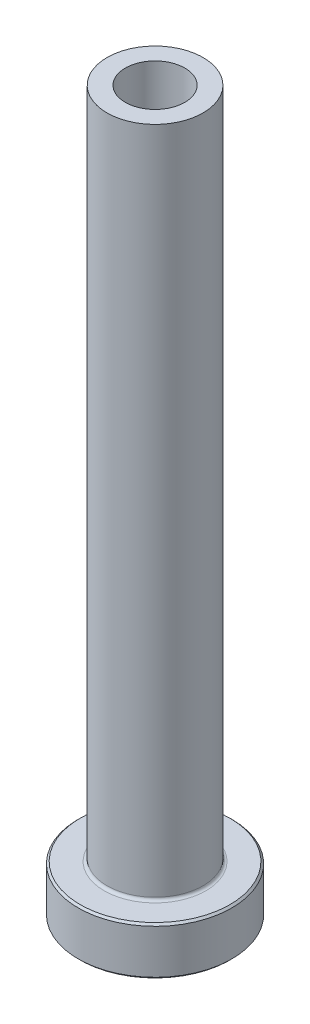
ISO-10303-21;
HEADER;
FILE_DESCRIPTION(('STEP AP214'),'2;1');
FILE_NAME('part.step','',(''),(''),'','','');
FILE_SCHEMA(('AUTOMOTIVE_DESIGN { 1 0 10303 214 1 1 1 1 }'));
ENDSEC;
DATA;
#1=APPLICATION_CONTEXT('core data for automotive mechanical design processes');
#2=APPLICATION_PROTOCOL_DEFINITION('international standard','automotive_design',2000,#1);
#3=PRODUCT_CONTEXT('',#1,'mechanical');
#4=PRODUCT('Part','Part','',(#3));
#5=PRODUCT_RELATED_PRODUCT_CATEGORY('part','',(#4));
#6=PRODUCT_DEFINITION_FORMATION('','',#4);
#7=PRODUCT_DEFINITION_CONTEXT('part definition',#1,'design');
#8=PRODUCT_DEFINITION('design','',#6,#7);
#9=PRODUCT_DEFINITION_SHAPE('','',#8);
#10=(LENGTH_UNIT() NAMED_UNIT(*) SI_UNIT(.MILLI.,.METRE.));
#11=(NAMED_UNIT(*) PLANE_ANGLE_UNIT() SI_UNIT($,.RADIAN.));
#12=(NAMED_UNIT(*) SI_UNIT($,.STERADIAN.) SOLID_ANGLE_UNIT());
#13=UNCERTAINTY_MEASURE_WITH_UNIT(LENGTH_MEASURE(1.E-05),#10,'distance_accuracy_value','');
#14=(GEOMETRIC_REPRESENTATION_CONTEXT(3) GLOBAL_UNCERTAINTY_ASSIGNED_CONTEXT((#13)) GLOBAL_UNIT_ASSIGNED_CONTEXT((#10,
#11,#12)) REPRESENTATION_CONTEXT('',''));
#15=CARTESIAN_POINT('',(0.,0.,0.));
#16=DIRECTION('',(0.,0.,1.));
#17=DIRECTION('',(1.,0.,0.));
#18=AXIS2_PLACEMENT_3D('',#15,#16,#17);
#19=CARTESIAN_POINT('',(0.,92.1876809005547,0.));
#20=DIRECTION('',(0.,1.,0.));
#21=DIRECTION('',(0.,0.,1.));
#22=AXIS2_PLACEMENT_3D('',#19,#20,#21);
#23=CYLINDRICAL_SURFACE('',#22,3.10000000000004);
#24=CARTESIAN_POINT('',(0.,75.,0.));
#25=DIRECTION('',(0.,1.,0.));
#26=DIRECTION('',(0.,0.,1.));
#27=AXIS2_PLACEMENT_3D('',#24,#25,#26);
#28=CIRCLE('',#27,3.10000000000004);
#29=CARTESIAN_POINT('',(0.,75.,3.10000000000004));
#30=VERTEX_POINT('',#29);
#31=EDGE_CURVE('E62',#30,#30,#28,.T.);
#32=ORIENTED_EDGE('',*,*,#31,.T.);
#33=EDGE_LOOP('',(#32));
#34=FACE_BOUND('',#33,.T.);
#35=CARTESIAN_POINT('',(0.,30.,0.));
#36=DIRECTION('',(0.,1.,0.));
#37=DIRECTION('',(0.,0.,1.));
#38=AXIS2_PLACEMENT_3D('',#35,#36,#37);
#39=CIRCLE('',#38,3.10000000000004);
#40=CARTESIAN_POINT('',(0.,30.,3.10000000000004));
#41=VERTEX_POINT('',#40);
#42=EDGE_CURVE('E71',#41,#41,#39,.T.);
#43=ORIENTED_EDGE('',*,*,#42,.F.);
#44=EDGE_LOOP('',(#43));
#45=FACE_BOUND('',#44,.T.);
#46=ADVANCED_FACE('F30',(#34,#45),#23,.F.);
#47=CARTESIAN_POINT('',(-3.10000000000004,75.,0.));
#48=DIRECTION('',(0.,1.,0.));
#49=DIRECTION('',(0.,0.,1.));
#50=AXIS2_PLACEMENT_3D('',#47,#48,#49);
#51=PLANE('',#50);
#52=CARTESIAN_POINT('',(0.,75.,0.));
#53=DIRECTION('',(0.,1.,0.));
#54=DIRECTION('',(0.,0.,1.));
#55=AXIS2_PLACEMENT_3D('',#52,#53,#54);
#56=CIRCLE('',#55,5.);
#57=CARTESIAN_POINT('',(0.,75.,5.));
#58=VERTEX_POINT('',#57);
#59=EDGE_CURVE('E65',#58,#58,#56,.T.);
#60=ORIENTED_EDGE('',*,*,#59,.T.);
#61=EDGE_LOOP('',(#60));
#62=FACE_BOUND('',#61,.T.);
#63=ORIENTED_EDGE('',*,*,#31,.F.);
#64=EDGE_LOOP('',(#63));
#65=FACE_BOUND('',#64,.T.);
#66=ADVANCED_FACE('F79',(#62,#65),#51,.T.);
#67=CARTESIAN_POINT('',(0.,92.1876809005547,0.));
#68=DIRECTION('',(0.,1.,0.));
#69=DIRECTION('',(0.,0.,1.));
#70=AXIS2_PLACEMENT_3D('',#67,#68,#69);
#71=CYLINDRICAL_SURFACE('',#70,4.99999999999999);
#72=CARTESIAN_POINT('',(0.,5.3,0.));
#73=DIRECTION('',(0.,1.,0.));
#74=DIRECTION('',(0.,0.,1.));
#75=AXIS2_PLACEMENT_3D('',#72,#73,#74);
#76=CIRCLE('',#75,4.99999999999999);
#77=CARTESIAN_POINT('',(0.,5.3,4.99999999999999));
#78=VERTEX_POINT('',#77);
#79=EDGE_CURVE('E59',#78,#78,#76,.T.);
#80=ORIENTED_EDGE('',*,*,#79,.T.);
#81=EDGE_LOOP('',(#80));
#82=FACE_BOUND('',#81,.T.);
#83=ORIENTED_EDGE('',*,*,#59,.F.);
#84=EDGE_LOOP('',(#83));
#85=FACE_BOUND('',#84,.T.);
#86=ADVANCED_FACE('F85',(#82,#85),#71,.T.);
#87=CARTESIAN_POINT('',(-4.99999999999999,5.,0.));
#88=DIRECTION('',(0.,1.,0.));
#89=DIRECTION('',(0.,0.,1.));
#90=AXIS2_PLACEMENT_3D('',#87,#88,#89);
#91=PLANE('',#90);
#92=CARTESIAN_POINT('',(0.,5.,0.));
#93=DIRECTION('',(0.,1.,0.));
#94=DIRECTION('',(0.,0.,1.));
#95=AXIS2_PLACEMENT_3D('',#92,#93,#94);
#96=CIRCLE('',#95,7.80000000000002);
#97=CARTESIAN_POINT('',(0.,5.,-7.80000000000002));
#98=VERTEX_POINT('',#97);
#99=EDGE_CURVE('E53',#98,#98,#96,.T.);
#100=ORIENTED_EDGE('',*,*,#99,.T.);
#101=EDGE_LOOP('',(#100));
#102=FACE_BOUND('',#101,.T.);
#103=CARTESIAN_POINT('',(0.,5.,0.));
#104=DIRECTION('',(0.,1.,0.));
#105=DIRECTION('',(0.,0.,1.));
#106=AXIS2_PLACEMENT_3D('',#103,#104,#105);
#107=CIRCLE('',#106,5.29999999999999);
#108=CARTESIAN_POINT('',(0.,5.,5.29999999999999));
#109=VERTEX_POINT('',#108);
#110=EDGE_CURVE('E56',#109,#109,#107,.F.);
#111=ORIENTED_EDGE('',*,*,#110,.T.);
#112=EDGE_LOOP('',(#111));
#113=FACE_BOUND('',#112,.T.);
#114=ADVANCED_FACE('F111',(#102,#113),#91,.T.);
#115=CARTESIAN_POINT('',(0.,92.1876809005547,0.));
#116=DIRECTION('',(0.,1.,0.));
#117=DIRECTION('',(0.,0.,1.));
#118=AXIS2_PLACEMENT_3D('',#115,#116,#117);
#119=CYLINDRICAL_SURFACE('',#118,7.99999999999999);
#120=CARTESIAN_POINT('',(0.,4.80000000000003,0.));
#121=DIRECTION('',(0.,1.,0.));
#122=DIRECTION('',(0.,0.,1.));
#123=AXIS2_PLACEMENT_3D('',#120,#121,#122);
#124=CIRCLE('',#123,7.99999999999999);
#125=CARTESIAN_POINT('',(0.,4.80000000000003,-7.99999999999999));
#126=VERTEX_POINT('',#125);
#127=EDGE_CURVE('E45',#126,#126,#124,.F.);
#128=ORIENTED_EDGE('',*,*,#127,.T.);
#129=EDGE_LOOP('',(#128));
#130=FACE_BOUND('',#129,.T.);
#131=CARTESIAN_POINT('',(0.,0.199999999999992,0.));
#132=DIRECTION('',(0.,-1.,0.));
#133=DIRECTION('',(0.,0.,-1.));
#134=AXIS2_PLACEMENT_3D('',#131,#132,#133);
#135=CIRCLE('',#134,7.99999999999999);
#136=CARTESIAN_POINT('',(0.,0.199999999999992,-7.99999999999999));
#137=VERTEX_POINT('',#136);
#138=EDGE_CURVE('E50',#137,#137,#135,.F.);
#139=ORIENTED_EDGE('',*,*,#138,.T.);
#140=EDGE_LOOP('',(#139));
#141=FACE_BOUND('',#140,.T.);
#142=ADVANCED_FACE('F108',(#130,#141),#119,.T.);
#143=CARTESIAN_POINT('',(-7.99999999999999,0.,0.));
#144=DIRECTION('',(0.,-1.,0.));
#145=DIRECTION('',(0.,0.,-1.));
#146=AXIS2_PLACEMENT_3D('',#143,#144,#145);
#147=PLANE('',#146);
#148=CARTESIAN_POINT('',(0.,0.,0.));
#149=DIRECTION('',(0.,-1.,0.));
#150=DIRECTION('',(0.,0.,-1.));
#151=AXIS2_PLACEMENT_3D('',#148,#149,#150);
#152=CIRCLE('',#151,3.84999999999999);
#153=CARTESIAN_POINT('',(0.,0.,-3.84999999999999));
#154=VERTEX_POINT('',#153);
#155=EDGE_CURVE('E37',#154,#154,#152,.F.);
#156=ORIENTED_EDGE('',*,*,#155,.T.);
#157=EDGE_LOOP('',(#156));
#158=FACE_BOUND('',#157,.T.);
#159=CARTESIAN_POINT('',(0.,0.,0.));
#160=DIRECTION('',(0.,-1.,0.));
#161=DIRECTION('',(0.,0.,-1.));
#162=AXIS2_PLACEMENT_3D('',#159,#160,#161);
#163=CIRCLE('',#162,7.79999999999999);
#164=CARTESIAN_POINT('',(0.,0.,-7.79999999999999));
#165=VERTEX_POINT('',#164);
#166=EDGE_CURVE('E41',#165,#165,#163,.T.);
#167=ORIENTED_EDGE('',*,*,#166,.T.);
#168=EDGE_LOOP('',(#167));
#169=FACE_BOUND('',#168,.T.);
#170=ADVANCED_FACE('F110',(#158,#169),#147,.T.);
#171=CARTESIAN_POINT('',(0.,92.1876809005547,0.));
#172=DIRECTION('',(0.,1.,0.));
#173=DIRECTION('',(0.,0.,1.));
#174=AXIS2_PLACEMENT_3D('',#171,#172,#173);
#175=CYLINDRICAL_SURFACE('',#174,3.34999999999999);
#176=CARTESIAN_POINT('',(0.,0.5,0.));
#177=DIRECTION('',(0.,-1.,0.));
#178=DIRECTION('',(0.,0.,-1.));
#179=AXIS2_PLACEMENT_3D('',#176,#177,#178);
#180=CIRCLE('',#179,3.34999999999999);
#181=CARTESIAN_POINT('',(0.,0.5,-3.34999999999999));
#182=VERTEX_POINT('',#181);
#183=EDGE_CURVE('E10',#182,#182,#180,.T.);
#184=ORIENTED_EDGE('',*,*,#183,.T.);
#185=EDGE_LOOP('',(#184));
#186=FACE_BOUND('',#185,.T.);
#187=CARTESIAN_POINT('',(0.,18.,0.));
#188=DIRECTION('',(0.,1.,0.));
#189=DIRECTION('',(0.,0.,1.));
#190=AXIS2_PLACEMENT_3D('',#187,#188,#189);
#191=CIRCLE('',#190,3.34999999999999);
#192=CARTESIAN_POINT('',(0.,18.,3.34999999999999));
#193=VERTEX_POINT('',#192);
#194=EDGE_CURVE('E68',#193,#193,#191,.T.);
#195=ORIENTED_EDGE('',*,*,#194,.T.);
#196=EDGE_LOOP('',(#195));
#197=FACE_BOUND('',#196,.T.);
#198=ADVANCED_FACE('F118',(#186,#197),#175,.F.);
#199=CARTESIAN_POINT('',(0.,18.,0.));
#200=DIRECTION('',(0.,-1.,0.));
#201=DIRECTION('',(0.,0.,-1.));
#202=AXIS2_PLACEMENT_3D('',#199,#200,#201);
#203=CONICAL_SURFACE('',#202,3.34999999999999,0.0208303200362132);
#204=ORIENTED_EDGE('',*,*,#42,.T.);
#205=EDGE_LOOP('',(#204));
#206=FACE_BOUND('',#205,.T.);
#207=ORIENTED_EDGE('',*,*,#194,.F.);
#208=EDGE_LOOP('',(#207));
#209=FACE_BOUND('',#208,.T.);
#210=ADVANCED_FACE('F75',(#206,#209),#203,.F.);
#211=CARTESIAN_POINT('',(0.,5.3,0.));
#212=DIRECTION('',(0.,1.,0.));
#213=DIRECTION('',(0.,0.,1.));
#214=AXIS2_PLACEMENT_3D('',#211,#212,#213);
#215=TOROIDAL_SURFACE('',#214,5.29999999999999,0.3);
#216=ORIENTED_EDGE('',*,*,#110,.F.);
#217=EDGE_LOOP('',(#216));
#218=FACE_BOUND('',#217,.T.);
#219=ORIENTED_EDGE('',*,*,#79,.F.);
#220=EDGE_LOOP('',(#219));
#221=FACE_BOUND('',#220,.T.);
#222=ADVANCED_FACE('F90',(#218,#221),#215,.F.);
#223=CARTESIAN_POINT('',(0.,5.,0.));
#224=DIRECTION('',(0.,-1.,0.));
#225=DIRECTION('',(0.,0.,-1.));
#226=AXIS2_PLACEMENT_3D('',#223,#224,#225);
#227=CONICAL_SURFACE('',#226,7.80000000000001,0.78539816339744);
#228=CARTESIAN_POINT('',(0.,4.80000000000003,-7.99999999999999));
#229=CARTESIAN_POINT('',(0.,4.80208333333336,-7.99791666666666));
#230=CARTESIAN_POINT('',(0.,4.80416666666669,-7.99583333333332));
#231=CARTESIAN_POINT('',(0.,4.80833333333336,-7.99166666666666));
#232=CARTESIAN_POINT('',(0.,4.81041666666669,-7.98958333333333));
#233=CARTESIAN_POINT('',(0.,4.81458333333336,-7.98541666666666));
#234=CARTESIAN_POINT('',(0.,4.81666666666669,-7.98333333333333));
#235=CARTESIAN_POINT('',(0.,4.82083333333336,-7.97916666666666));
#236=CARTESIAN_POINT('',(0.,4.82291666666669,-7.97708333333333));
#237=CARTESIAN_POINT('',(0.,4.82708333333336,-7.97291666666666));
#238=CARTESIAN_POINT('',(0.,4.82916666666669,-7.97083333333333));
#239=CARTESIAN_POINT('',(0.,4.83333333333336,-7.96666666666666));
#240=CARTESIAN_POINT('',(0.,4.83541666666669,-7.96458333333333));
#241=CARTESIAN_POINT('',(0.,4.83958333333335,-7.96041666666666));
#242=CARTESIAN_POINT('',(0.,4.84166666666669,-7.95833333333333));
#243=CARTESIAN_POINT('',(0.,4.84583333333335,-7.95416666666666));
#244=CARTESIAN_POINT('',(0.,4.84791666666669,-7.95208333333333));
#245=CARTESIAN_POINT('',(0.,4.85208333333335,-7.94791666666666));
#246=CARTESIAN_POINT('',(0.,4.85416666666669,-7.94583333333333));
#247=CARTESIAN_POINT('',(0.,4.85833333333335,-7.94166666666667));
#248=CARTESIAN_POINT('',(0.,4.86041666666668,-7.93958333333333));
#249=CARTESIAN_POINT('',(0.,4.86458333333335,-7.93541666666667));
#250=CARTESIAN_POINT('',(0.,4.86666666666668,-7.93333333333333));
#251=CARTESIAN_POINT('',(0.,4.87083333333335,-7.92916666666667));
#252=CARTESIAN_POINT('',(0.,4.87291666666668,-7.92708333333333));
#253=CARTESIAN_POINT('',(0.,4.87708333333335,-7.92291666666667));
#254=CARTESIAN_POINT('',(0.,4.87916666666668,-7.92083333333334));
#255=CARTESIAN_POINT('',(0.,4.88333333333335,-7.91666666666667));
#256=CARTESIAN_POINT('',(0.,4.88541666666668,-7.91458333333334));
#257=CARTESIAN_POINT('',(0.,4.88958333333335,-7.91041666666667));
#258=CARTESIAN_POINT('',(0.,4.89166666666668,-7.90833333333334));
#259=CARTESIAN_POINT('',(0.,4.89583333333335,-7.90416666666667));
#260=CARTESIAN_POINT('',(0.,4.89791666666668,-7.90208333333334));
#261=CARTESIAN_POINT('',(0.,4.90208333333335,-7.89791666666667));
#262=CARTESIAN_POINT('',(0.,4.90416666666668,-7.89583333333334));
#263=CARTESIAN_POINT('',(0.,4.90833333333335,-7.89166666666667));
#264=CARTESIAN_POINT('',(0.,4.91041666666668,-7.88958333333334));
#265=CARTESIAN_POINT('',(0.,4.91458333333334,-7.88541666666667));
#266=CARTESIAN_POINT('',(0.,4.91666666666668,-7.88333333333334));
#267=CARTESIAN_POINT('',(0.,4.92083333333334,-7.87916666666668));
#268=CARTESIAN_POINT('',(0.,4.92291666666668,-7.87708333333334));
#269=CARTESIAN_POINT('',(0.,4.92708333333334,-7.87291666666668));
#270=CARTESIAN_POINT('',(0.,4.92916666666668,-7.87083333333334));
#271=CARTESIAN_POINT('',(0.,4.93333333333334,-7.86666666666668));
#272=CARTESIAN_POINT('',(0.,4.93541666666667,-7.86458333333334));
#273=CARTESIAN_POINT('',(0.,4.93958333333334,-7.86041666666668));
#274=CARTESIAN_POINT('',(0.,4.94166666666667,-7.85833333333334));
#275=CARTESIAN_POINT('',(0.,4.94583333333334,-7.85416666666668));
#276=CARTESIAN_POINT('',(0.,4.94791666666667,-7.85208333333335));
#277=CARTESIAN_POINT('',(0.,4.95208333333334,-7.84791666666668));
#278=CARTESIAN_POINT('',(0.,4.95416666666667,-7.84583333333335));
#279=CARTESIAN_POINT('',(0.,4.95833333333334,-7.84166666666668));
#280=CARTESIAN_POINT('',(0.,4.96041666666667,-7.83958333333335));
#281=CARTESIAN_POINT('',(0.,4.96458333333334,-7.83541666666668));
#282=CARTESIAN_POINT('',(0.,4.96666666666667,-7.83333333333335));
#283=CARTESIAN_POINT('',(0.,4.97083333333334,-7.82916666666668));
#284=CARTESIAN_POINT('',(0.,4.97291666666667,-7.82708333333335));
#285=CARTESIAN_POINT('',(0.,4.97708333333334,-7.82291666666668));
#286=CARTESIAN_POINT('',(0.,4.97916666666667,-7.82083333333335));
#287=CARTESIAN_POINT('',(0.,4.98333333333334,-7.81666666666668));
#288=CARTESIAN_POINT('',(0.,4.98541666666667,-7.81458333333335));
#289=CARTESIAN_POINT('',(0.,4.98958333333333,-7.81041666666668));
#290=CARTESIAN_POINT('',(0.,4.99166666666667,-7.80833333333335));
#291=CARTESIAN_POINT('',(0.,4.99583333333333,-7.80416666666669));
#292=CARTESIAN_POINT('',(0.,4.99791666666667,-7.80208333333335));
#293=CARTESIAN_POINT('',(0.,5.,-7.80000000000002));
#294=B_SPLINE_CURVE_WITH_KNOTS('',3,(#228,#229,#230,#231,#232,#233,#234,#235,#236,#237,#238,
#239,#240,#241,#242,#243,#244,#245,#246,#247,#248,#249,#250,#251,#252,#253,#254,#255,#256,#257,
#258,#259,#260,#261,#262,#263,#264,#265,#266,#267,#268,#269,#270,#271,#272,#273,#274,#275,#276,
#277,#278,#279,#280,#281,#282,#283,#284,#285,#286,#287,#288,#289,#290,#291,#292,#293),
.UNSPECIFIED.,.F.,.F.,(4,2,2,2,2,2,2,2,2,2,2,2,2,2,2,2,2,2,2,2,2,2,2,2,2,2,2,2,2,2,2,2,4),(0.,
0.00883883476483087,0.0176776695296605,0.0265165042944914,0.0353553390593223,0.0441941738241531,
0.053033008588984,0.0618718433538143,0.0707106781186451,0.0795495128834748,0.0883883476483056,
0.0972271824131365,0.106066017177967,0.114904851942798,0.123743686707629,0.132582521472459,
0.141421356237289,0.15026019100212,0.159099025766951,0.167937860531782,0.176776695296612,
0.185615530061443,0.194454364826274,0.203293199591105,0.212132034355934,0.220970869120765,
0.229809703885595,0.238648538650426,0.247487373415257,0.256326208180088,0.265165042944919,
0.274003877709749,0.28284271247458),.UNSPECIFIED.);
#295=EDGE_CURVE('BSEAM93',#126,#98,#294,.T.);
#296=ORIENTED_EDGE('',*,*,#127,.F.);
#297=ORIENTED_EDGE('',*,*,#99,.F.);
#298=ORIENTED_EDGE('',*,*,#295,.T.);
#299=ORIENTED_EDGE('',*,*,#295,.F.);
#300=EDGE_LOOP('',(#296,#298,#297,#299));
#301=FACE_BOUND('',#300,.T.);
#302=ADVANCED_FACE('F93',(#301),#227,.T.);
#303=CARTESIAN_POINT('',(0.,0.199999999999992,0.));
#304=DIRECTION('',(0.,1.,0.));
#305=DIRECTION('',(0.,0.,1.));
#306=AXIS2_PLACEMENT_3D('',#303,#304,#305);
#307=CONICAL_SURFACE('',#306,7.99999999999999,0.785398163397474);
#308=ORIENTED_EDGE('',*,*,#166,.F.);
#309=EDGE_LOOP('',(#308));
#310=FACE_BOUND('',#309,.T.);
#311=ORIENTED_EDGE('',*,*,#138,.F.);
#312=EDGE_LOOP('',(#311));
#313=FACE_BOUND('',#312,.T.);
#314=ADVANCED_FACE('F96',(#310,#313),#307,.T.);
#315=CARTESIAN_POINT('',(0.,0.,0.));
#316=DIRECTION('',(0.,-1.,0.));
#317=DIRECTION('',(0.,0.,-1.));
#318=AXIS2_PLACEMENT_3D('',#315,#316,#317);
#319=CONICAL_SURFACE('',#318,3.84999999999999,0.785398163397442);
#320=ORIENTED_EDGE('',*,*,#183,.F.);
#321=EDGE_LOOP('',(#320));
#322=FACE_BOUND('',#321,.T.);
#323=ORIENTED_EDGE('',*,*,#155,.F.);
#324=EDGE_LOOP('',(#323));
#325=FACE_BOUND('',#324,.T.);
#326=ADVANCED_FACE('F32',(#322,#325),#319,.F.);
#327=CLOSED_SHELL('',(#46,#66,#86,#114,#142,#170,#198,#210,#222,#302,#314,#326));
#328=MANIFOLD_SOLID_BREP('B2',#327);
#329=ADVANCED_BREP_SHAPE_REPRESENTATION('',(#18,#328),#14);
#330=SHAPE_DEFINITION_REPRESENTATION(#9,#329);
ENDSEC;
END-ISO-10303-21;
